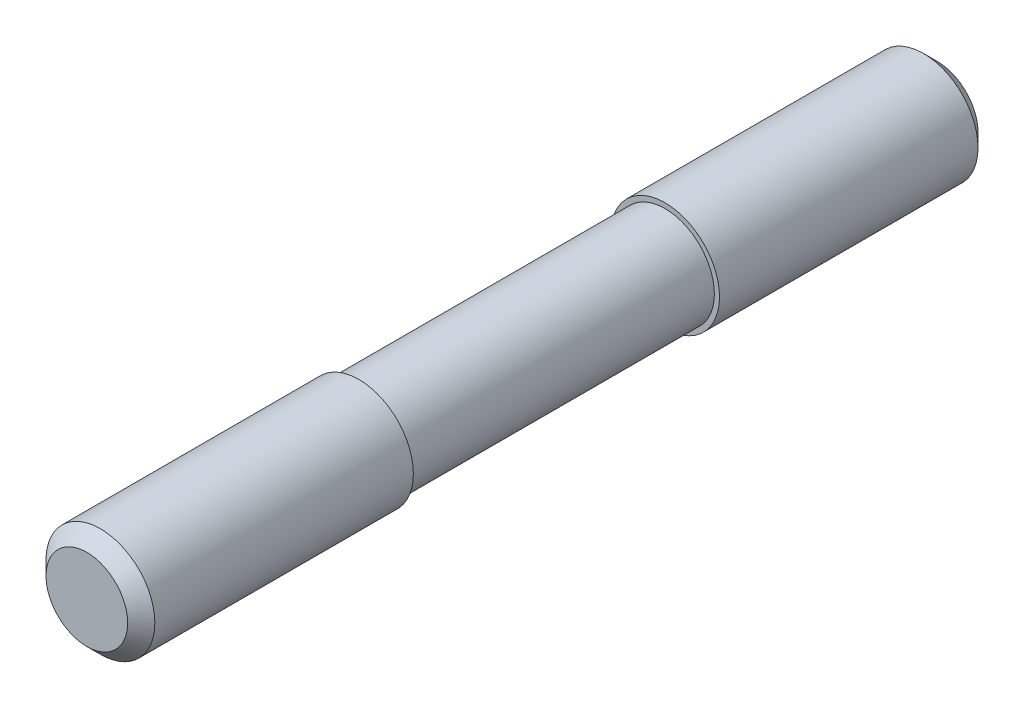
ISO-10303-21;
HEADER;
FILE_DESCRIPTION(('STEP AP214'),'2;1');
FILE_NAME('part.step','',(''),(''),'','','');
FILE_SCHEMA(('AUTOMOTIVE_DESIGN { 1 0 10303 214 1 1 1 1 }'));
ENDSEC;
DATA;
#1=APPLICATION_CONTEXT('core data for automotive mechanical design processes');
#2=APPLICATION_PROTOCOL_DEFINITION('international standard','automotive_design',2000,#1);
#3=PRODUCT_CONTEXT('',#1,'mechanical');
#4=PRODUCT('Part','Part','',(#3));
#5=PRODUCT_RELATED_PRODUCT_CATEGORY('part','',(#4));
#6=PRODUCT_DEFINITION_FORMATION('','',#4);
#7=PRODUCT_DEFINITION_CONTEXT('part definition',#1,'design');
#8=PRODUCT_DEFINITION('design','',#6,#7);
#9=PRODUCT_DEFINITION_SHAPE('','',#8);
#10=(LENGTH_UNIT() NAMED_UNIT(*) SI_UNIT(.MILLI.,.METRE.));
#11=(NAMED_UNIT(*) PLANE_ANGLE_UNIT() SI_UNIT($,.RADIAN.));
#12=(NAMED_UNIT(*) SI_UNIT($,.STERADIAN.) SOLID_ANGLE_UNIT());
#13=UNCERTAINTY_MEASURE_WITH_UNIT(LENGTH_MEASURE(1.E-05),#10,'distance_accuracy_value','');
#14=(GEOMETRIC_REPRESENTATION_CONTEXT(3) GLOBAL_UNCERTAINTY_ASSIGNED_CONTEXT((#13)) GLOBAL_UNIT_ASSIGNED_CONTEXT((#10,
#11,#12)) REPRESENTATION_CONTEXT('',''));
#15=CARTESIAN_POINT('',(0.,0.,0.));
#16=DIRECTION('',(0.,0.,1.));
#17=DIRECTION('',(1.,0.,0.));
#18=AXIS2_PLACEMENT_3D('',#15,#16,#17);
#19=CARTESIAN_POINT('',(0.,0.,0.));
#20=DIRECTION('',(0.,0.,1.));
#21=DIRECTION('',(1.,0.,0.));
#22=AXIS2_PLACEMENT_3D('',#19,#20,#21);
#23=PLANE('',#22);
#24=CARTESIAN_POINT('',(0.,0.,0.));
#25=DIRECTION('',(0.,0.,1.));
#26=DIRECTION('',(1.,0.,0.));
#27=AXIS2_PLACEMENT_3D('',#24,#25,#26);
#28=CIRCLE('',#27,6.);
#29=CARTESIAN_POINT('',(6.,0.,0.));
#30=VERTEX_POINT('',#29);
#31=EDGE_CURVE('E8',#30,#30,#28,.T.);
#32=ORIENTED_EDGE('',*,*,#31,.F.);
#33=EDGE_LOOP('',(#32));
#34=FACE_BOUND('',#33,.T.);
#35=ADVANCED_FACE('F12',(#34),#23,.F.);
#36=CARTESIAN_POINT('',(0.,0.,2.));
#37=DIRECTION('',(0.,0.,1.));
#38=DIRECTION('',(1.,0.,0.));
#39=AXIS2_PLACEMENT_3D('',#36,#37,#38);
#40=CONICAL_SURFACE('',#39,8.,0.785398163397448);
#41=ORIENTED_EDGE('',*,*,#31,.T.);
#42=EDGE_LOOP('',(#41));
#43=FACE_BOUND('',#42,.T.);
#44=CARTESIAN_POINT('',(0.,0.,2.));
#45=DIRECTION('',(0.,0.,1.));
#46=DIRECTION('',(1.,0.,0.));
#47=AXIS2_PLACEMENT_3D('',#44,#45,#46);
#48=CIRCLE('',#47,8.);
#49=CARTESIAN_POINT('',(8.,0.,2.));
#50=VERTEX_POINT('',#49);
#51=EDGE_CURVE('E18',#50,#50,#48,.T.);
#52=ORIENTED_EDGE('',*,*,#51,.F.);
#53=EDGE_LOOP('',(#52));
#54=FACE_BOUND('',#53,.T.);
#55=ADVANCED_FACE('F62',(#43,#54),#40,.T.);
#56=CARTESIAN_POINT('',(0.,0.,70.));
#57=DIRECTION('',(0.,0.,1.));
#58=DIRECTION('',(1.,0.,0.));
#59=AXIS2_PLACEMENT_3D('',#56,#57,#58);
#60=CYLINDRICAL_SURFACE('',#59,8.);
#61=CARTESIAN_POINT('',(0.,0.,40.));
#62=DIRECTION('',(0.,0.,1.));
#63=DIRECTION('',(1.,0.,0.));
#64=AXIS2_PLACEMENT_3D('',#61,#62,#63);
#65=CIRCLE('',#64,8.);
#66=CARTESIAN_POINT('',(8.,0.,40.));
#67=VERTEX_POINT('',#66);
#68=EDGE_CURVE('E22',#67,#67,#65,.T.);
#69=ORIENTED_EDGE('',*,*,#68,.F.);
#70=EDGE_LOOP('',(#69));
#71=FACE_BOUND('',#70,.T.);
#72=ORIENTED_EDGE('',*,*,#51,.T.);
#73=EDGE_LOOP('',(#72));
#74=FACE_BOUND('',#73,.T.);
#75=ADVANCED_FACE('F68',(#71,#74),#60,.T.);
#76=CARTESIAN_POINT('',(8.,0.,40.));
#77=DIRECTION('',(0.,0.,-1.));
#78=DIRECTION('',(-1.,0.,0.));
#79=AXIS2_PLACEMENT_3D('',#76,#77,#78);
#80=PLANE('',#79);
#81=CARTESIAN_POINT('',(0.,0.,40.));
#82=DIRECTION('',(0.,0.,1.));
#83=DIRECTION('',(1.,0.,0.));
#84=AXIS2_PLACEMENT_3D('',#81,#82,#83);
#85=CIRCLE('',#84,7.25);
#86=CARTESIAN_POINT('',(7.25,0.,40.));
#87=VERTEX_POINT('',#86);
#88=EDGE_CURVE('E26',#87,#87,#85,.T.);
#89=ORIENTED_EDGE('',*,*,#88,.F.);
#90=EDGE_LOOP('',(#89));
#91=FACE_BOUND('',#90,.T.);
#92=ORIENTED_EDGE('',*,*,#68,.T.);
#93=EDGE_LOOP('',(#92));
#94=FACE_BOUND('',#93,.T.);
#95=ADVANCED_FACE('F73',(#91,#94),#80,.F.);
#96=CARTESIAN_POINT('',(0.,0.,70.));
#97=DIRECTION('',(0.,0.,1.));
#98=DIRECTION('',(1.,0.,0.));
#99=AXIS2_PLACEMENT_3D('',#96,#97,#98);
#100=CYLINDRICAL_SURFACE('',#99,7.25);
#101=CARTESIAN_POINT('',(0.,0.,85.));
#102=DIRECTION('',(0.,0.,1.));
#103=DIRECTION('',(1.,0.,0.));
#104=AXIS2_PLACEMENT_3D('',#101,#102,#103);
#105=CIRCLE('',#104,7.25);
#106=CARTESIAN_POINT('',(7.25,0.,85.));
#107=VERTEX_POINT('',#106);
#108=EDGE_CURVE('E31',#107,#107,#105,.T.);
#109=ORIENTED_EDGE('',*,*,#108,.F.);
#110=EDGE_LOOP('',(#109));
#111=FACE_BOUND('',#110,.T.);
#112=ORIENTED_EDGE('',*,*,#88,.T.);
#113=EDGE_LOOP('',(#112));
#114=FACE_BOUND('',#113,.T.);
#115=ADVANCED_FACE('F80',(#111,#114),#100,.T.);
#116=CARTESIAN_POINT('',(7.25,0.,85.));
#117=DIRECTION('',(0.,0.,1.));
#118=DIRECTION('',(1.,0.,0.));
#119=AXIS2_PLACEMENT_3D('',#116,#117,#118);
#120=PLANE('',#119);
#121=CARTESIAN_POINT('',(0.,0.,85.));
#122=DIRECTION('',(0.,0.,1.));
#123=DIRECTION('',(1.,0.,0.));
#124=AXIS2_PLACEMENT_3D('',#121,#122,#123);
#125=CIRCLE('',#124,8.);
#126=CARTESIAN_POINT('',(8.,0.,85.));
#127=VERTEX_POINT('',#126);
#128=EDGE_CURVE('E34',#127,#127,#125,.T.);
#129=ORIENTED_EDGE('',*,*,#128,.F.);
#130=EDGE_LOOP('',(#129));
#131=FACE_BOUND('',#130,.T.);
#132=ORIENTED_EDGE('',*,*,#108,.T.);
#133=EDGE_LOOP('',(#132));
#134=FACE_BOUND('',#133,.T.);
#135=ADVANCED_FACE('F58',(#131,#134),#120,.F.);
#136=CARTESIAN_POINT('',(0.,0.,70.));
#137=DIRECTION('',(0.,0.,1.));
#138=DIRECTION('',(1.,0.,0.));
#139=AXIS2_PLACEMENT_3D('',#136,#137,#138);
#140=CYLINDRICAL_SURFACE('',#139,8.);
#141=CARTESIAN_POINT('',(0.,0.,123.));
#142=DIRECTION('',(0.,0.,1.));
#143=DIRECTION('',(1.,0.,0.));
#144=AXIS2_PLACEMENT_3D('',#141,#142,#143);
#145=CIRCLE('',#144,8.);
#146=CARTESIAN_POINT('',(8.,0.,123.));
#147=VERTEX_POINT('',#146);
#148=EDGE_CURVE('E37',#147,#147,#145,.T.);
#149=ORIENTED_EDGE('',*,*,#148,.F.);
#150=EDGE_LOOP('',(#149));
#151=FACE_BOUND('',#150,.T.);
#152=ORIENTED_EDGE('',*,*,#128,.T.);
#153=EDGE_LOOP('',(#152));
#154=FACE_BOUND('',#153,.T.);
#155=ADVANCED_FACE('F48',(#151,#154),#140,.T.);
#156=CARTESIAN_POINT('',(0.,0.,125.));
#157=DIRECTION('',(0.,0.,-1.));
#158=DIRECTION('',(-1.,0.,0.));
#159=AXIS2_PLACEMENT_3D('',#156,#157,#158);
#160=CONICAL_SURFACE('',#159,6.,0.785398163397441);
#161=ORIENTED_EDGE('',*,*,#148,.T.);
#162=EDGE_LOOP('',(#161));
#163=FACE_BOUND('',#162,.T.);
#164=CARTESIAN_POINT('',(0.,0.,125.));
#165=DIRECTION('',(0.,0.,1.));
#166=DIRECTION('',(1.,0.,0.));
#167=AXIS2_PLACEMENT_3D('',#164,#165,#166);
#168=CIRCLE('',#167,6.);
#169=CARTESIAN_POINT('',(6.,0.,125.));
#170=VERTEX_POINT('',#169);
#171=EDGE_CURVE('E40',#170,#170,#168,.T.);
#172=ORIENTED_EDGE('',*,*,#171,.F.);
#173=EDGE_LOOP('',(#172));
#174=FACE_BOUND('',#173,.T.);
#175=ADVANCED_FACE('F46',(#163,#174),#160,.T.);
#176=CARTESIAN_POINT('',(6.,0.,125.));
#177=DIRECTION('',(0.,0.,-1.));
#178=DIRECTION('',(-1.,0.,0.));
#179=AXIS2_PLACEMENT_3D('',#176,#177,#178);
#180=PLANE('',#179);
#181=ORIENTED_EDGE('',*,*,#171,.T.);
#182=EDGE_LOOP('',(#181));
#183=FACE_BOUND('',#182,.T.);
#184=ADVANCED_FACE('F44',(#183),#180,.F.);
#185=CLOSED_SHELL('',(#35,#55,#75,#95,#115,#135,#155,#175,#184));
#186=MANIFOLD_SOLID_BREP('B1',#185);
#187=ADVANCED_BREP_SHAPE_REPRESENTATION('',(#18,#186),#14);
#188=SHAPE_DEFINITION_REPRESENTATION(#9,#187);
ENDSEC;
END-ISO-10303-21;
